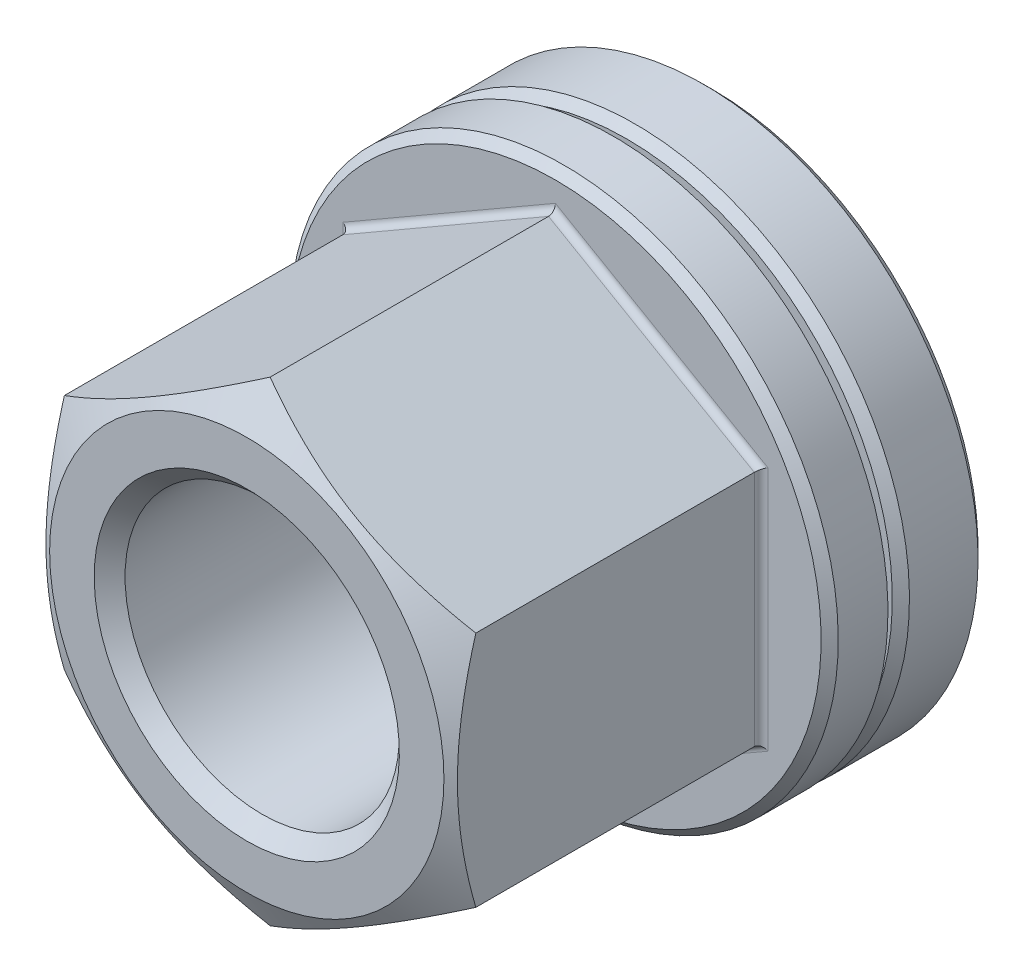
ISO-10303-21;
HEADER;
FILE_DESCRIPTION(('STEP AP214'),'2;1');
FILE_NAME('part.step','',(''),(''),'','','');
FILE_SCHEMA(('AUTOMOTIVE_DESIGN { 1 0 10303 214 1 1 1 1 }'));
ENDSEC;
DATA;
#1=APPLICATION_CONTEXT('core data for automotive mechanical design processes');
#2=APPLICATION_PROTOCOL_DEFINITION('international standard','automotive_design',2000,#1);
#3=PRODUCT_CONTEXT('',#1,'mechanical');
#4=PRODUCT('Part','Part','',(#3));
#5=PRODUCT_RELATED_PRODUCT_CATEGORY('part','',(#4));
#6=PRODUCT_DEFINITION_FORMATION('','',#4);
#7=PRODUCT_DEFINITION_CONTEXT('part definition',#1,'design');
#8=PRODUCT_DEFINITION('design','',#6,#7);
#9=PRODUCT_DEFINITION_SHAPE('','',#8);
#10=(LENGTH_UNIT() NAMED_UNIT(*) SI_UNIT(.MILLI.,.METRE.));
#11=(NAMED_UNIT(*) PLANE_ANGLE_UNIT() SI_UNIT($,.RADIAN.));
#12=(NAMED_UNIT(*) SI_UNIT($,.STERADIAN.) SOLID_ANGLE_UNIT());
#13=UNCERTAINTY_MEASURE_WITH_UNIT(LENGTH_MEASURE(1.E-05),#10,'distance_accuracy_value','');
#14=(GEOMETRIC_REPRESENTATION_CONTEXT(3) GLOBAL_UNCERTAINTY_ASSIGNED_CONTEXT((#13)) GLOBAL_UNIT_ASSIGNED_CONTEXT((#10,
#11,#12)) REPRESENTATION_CONTEXT('',''));
#15=CARTESIAN_POINT('',(0.,0.,0.));
#16=DIRECTION('',(0.,0.,1.));
#17=DIRECTION('',(1.,0.,0.));
#18=AXIS2_PLACEMENT_3D('',#15,#16,#17);
#19=CARTESIAN_POINT('',(1.19343424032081E-08,0.,36.8822269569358));
#20=DIRECTION('',(0.,0.,1.));
#21=DIRECTION('',(-1.,0.,0.));
#22=AXIS2_PLACEMENT_3D('',#19,#20,#21);
#23=SPHERICAL_SURFACE('',#22,35.0000001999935);
#24=CARTESIAN_POINT('',(0.,0.,5.));
#25=DIRECTION('',(0.,0.,1.));
#26=DIRECTION('',(0.,-1.,0.));
#27=AXIS2_PLACEMENT_3D('',#24,#25,#26);
#28=CIRCLE('',#27,14.4403468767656);
#29=CARTESIAN_POINT('',(-14.4403468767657,0.,5.));
#30=VERTEX_POINT('',#29);
#31=EDGE_CURVE('E105',#30,#30,#28,.T.);
#32=CARTESIAN_POINT('',(0.,0.,5.75346191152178));
#33=DIRECTION('',(0.,0.,1.));
#34=DIRECTION('',(0.,-1.,0.));
#35=AXIS2_PLACEMENT_3D('',#32,#33,#34);
#36=CIRCLE('',#35,16.0000000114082);
#37=CARTESIAN_POINT('',(-16.0000000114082,0.,5.75346191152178));
#38=VERTEX_POINT('',#37);
#39=EDGE_CURVE('E320',#38,#38,#36,.T.);
#40=CARTESIAN_POINT('',(-14.4403468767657,0.,5.));
#41=CARTESIAN_POINT('',(-14.4567841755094,0.,5.0074449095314));
#42=CARTESIAN_POINT('',(-14.4732157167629,0.,5.01490253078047));
#43=CARTESIAN_POINT('',(-14.5060672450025,0.,5.02984317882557));
#44=CARTESIAN_POINT('',(-14.5224872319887,0.,5.0373262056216));
#45=CARTESIAN_POINT('',(-14.5553156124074,0.,5.05231764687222));
#46=CARTESIAN_POINT('',(-14.5717240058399,0.,5.05982606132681));
#47=CARTESIAN_POINT('',(-14.6045291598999,0.,5.07486825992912));
#48=CARTESIAN_POINT('',(-14.6209259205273,0.,5.08240204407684));
#49=CARTESIAN_POINT('',(-14.6537077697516,0.,5.09749496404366));
#50=CARTESIAN_POINT('',(-14.6700928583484,0.,5.10505409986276));
#51=CARTESIAN_POINT('',(-14.7028513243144,0.,5.12019770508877));
#52=CARTESIAN_POINT('',(-14.7192247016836,0.,5.12778217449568));
#53=CARTESIAN_POINT('',(-14.7519597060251,0.,5.14297642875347));
#54=CARTESIAN_POINT('',(-14.7683213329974,0.,5.15058621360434));
#55=CARTESIAN_POINT('',(-14.8010327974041,0.,5.16583108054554));
#56=CARTESIAN_POINT('',(-14.8173826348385,0.,5.17346616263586));
#57=CARTESIAN_POINT('',(-14.8500704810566,0.,5.18876160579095));
#58=CARTESIAN_POINT('',(-14.8664084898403,0.,5.19642196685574));
#59=CARTESIAN_POINT('',(-14.8990726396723,0.,5.21176794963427));
#60=CARTESIAN_POINT('',(-14.9153987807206,0.,5.21945357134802));
#61=CARTESIAN_POINT('',(-14.9480391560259,0.,5.23485005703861));
#62=CARTESIAN_POINT('',(-14.9643533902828,0.,5.24256092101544));
#63=CARTESIAN_POINT('',(-14.9969699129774,0.,5.25800787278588));
#64=CARTESIAN_POINT('',(-15.0132722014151,0.,5.26574396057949));
#65=CARTESIAN_POINT('',(-15.0458647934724,0.,5.28124134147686));
#66=CARTESIAN_POINT('',(-15.0621550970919,0.,5.28900263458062));
#67=CARTESIAN_POINT('',(-15.0947236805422,0.,5.30455040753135));
#68=CARTESIAN_POINT('',(-15.111001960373,0.,5.31233688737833));
#69=CARTESIAN_POINT('',(-15.1435464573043,0.,5.32793501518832));
#70=CARTESIAN_POINT('',(-15.1598126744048,0.,5.33574666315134));
#71=CARTESIAN_POINT('',(-15.1923330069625,0.,5.35139510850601));
#72=CARTESIAN_POINT('',(-15.2085871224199,0.,5.35923190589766));
#73=CARTESIAN_POINT('',(-15.2410832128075,0.,5.37493063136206));
#74=CARTESIAN_POINT('',(-15.2573251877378,0.,5.38279255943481));
#75=CARTESIAN_POINT('',(-15.2897969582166,0.,5.39854152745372));
#76=CARTESIAN_POINT('',(-15.3060267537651,0.,5.40642856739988));
#77=CARTESIAN_POINT('',(-15.3384741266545,0.,5.42222774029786));
#78=CARTESIAN_POINT('',(-15.3546917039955,0.,5.43013987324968));
#79=CARTESIAN_POINT('',(-15.3871146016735,0.,5.44598921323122));
#80=CARTESIAN_POINT('',(-15.4033199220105,0.,5.45392642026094));
#81=CARTESIAN_POINT('',(-15.4357182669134,0.,5.46982588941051));
#82=CARTESIAN_POINT('',(-15.4519112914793,0.,5.47778815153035));
#83=CARTESIAN_POINT('',(-15.4842850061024,0.,5.49373771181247));
#84=CARTESIAN_POINT('',(-15.5004656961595,0.,5.50172500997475));
#85=CARTESIAN_POINT('',(-15.5328147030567,0.,5.51772462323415));
#86=CARTESIAN_POINT('',(-15.5489830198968,0.,5.52573693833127));
#87=CARTESIAN_POINT('',(-15.5813072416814,0.,5.54178656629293));
#88=CARTESIAN_POINT('',(-15.5974631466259,0.,5.54982387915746));
#89=CARTESIAN_POINT('',(-15.6297625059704,0.,5.56592348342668));
#90=CARTESIAN_POINT('',(-15.6459059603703,0.,5.57398577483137));
#91=CARTESIAN_POINT('',(-15.6781803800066,0.,5.59013531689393));
#92=CARTESIAN_POINT('',(-15.6943113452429,0.,5.5982225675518));
#93=CARTESIAN_POINT('',(-15.7265607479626,0.,5.61442200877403));
#94=CARTESIAN_POINT('',(-15.7426791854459,0.,5.62253419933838));
#95=CARTESIAN_POINT('',(-15.7749034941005,0.,5.63878350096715));
#96=CARTESIAN_POINT('',(-15.7910093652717,0.,5.64692061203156));
#97=CARTESIAN_POINT('',(-15.8232085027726,0.,5.66321973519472));
#98=CARTESIAN_POINT('',(-15.8393017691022,0.,5.67138174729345));
#99=CARTESIAN_POINT('',(-15.8714756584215,0.,5.68773065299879));
#100=CARTESIAN_POINT('',(-15.887556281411,0.,5.6959175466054));
#101=CARTESIAN_POINT('',(-15.9197048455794,0.,5.71231619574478));
#102=CARTESIAN_POINT('',(-15.9357727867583,0.,5.72052795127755));
#103=CARTESIAN_POINT('',(-15.9678959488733,0.,5.73697630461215));
#104=CARTESIAN_POINT('',(-15.9839511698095,0.,5.74521290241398));
#105=CARTESIAN_POINT('',(-16.0000000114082,0.,5.75346191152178));
#106=B_SPLINE_CURVE_WITH_KNOTS('',3,(#40,#41,#42,#43,#44,#45,#46,#47,#48,#49,#50,#51,#52,#53,
#54,#55,#56,#57,#58,#59,#60,#61,#62,#63,#64,#65,#66,#67,#68,#69,#70,#71,#72,#73,#74,#75,#76,#77,
#78,#79,#80,#81,#82,#83,#84,#85,#86,#87,#88,#89,#90,#91,#92,#93,#94,#95,#96,#97,#98,#99,#100,
#101,#102,#103,#104,#105),.UNSPECIFIED.,.F.,.F.,(4,2,2,2,2,2,2,2,2,2,2,2,2,2,2,2,2,2,2,2,2,2,2,
2,2,2,2,2,2,2,2,2,4),(0.,0.0541341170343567,0.108268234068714,0.162402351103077,
0.216536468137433,0.270670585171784,0.324804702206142,0.378938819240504,0.433072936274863,
0.487207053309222,0.54134117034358,0.595475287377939,0.649609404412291,0.70374352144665,
0.757877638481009,0.812011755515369,0.866145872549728,0.920279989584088,0.974414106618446,
1.0285482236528,1.08268234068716,1.13681645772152,1.19095057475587,1.24508469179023,
1.29921880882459,1.35335292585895,1.40748704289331,1.46162115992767,1.51575527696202,
1.56988939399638,1.62402351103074,1.6781576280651,1.73229174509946),.UNSPECIFIED.);
#107=EDGE_CURVE('BSEAM14',#30,#38,#106,.T.);
#108=ORIENTED_EDGE('',*,*,#31,.T.);
#109=ORIENTED_EDGE('',*,*,#39,.F.);
#110=ORIENTED_EDGE('',*,*,#107,.T.);
#111=ORIENTED_EDGE('',*,*,#107,.F.);
#112=EDGE_LOOP('',(#108,#110,#109,#111));
#113=FACE_BOUND('',#112,.T.);
#114=ADVANCED_FACE('F14',(#113),#23,.T.);
#115=CARTESIAN_POINT('',(-15.5,0.,5.));
#116=DIRECTION('',(0.,0.,1.));
#117=DIRECTION('',(0.,-1.,0.));
#118=AXIS2_PLACEMENT_3D('',#115,#116,#117);
#119=PLANE('',#118);
#120=CARTESIAN_POINT('',(0.,0.,5.));
#121=DIRECTION('',(0.,0.,1.));
#122=DIRECTION('',(0.,-1.,0.));
#123=AXIS2_PLACEMENT_3D('',#120,#121,#122);
#124=CIRCLE('',#123,15.5);
#125=CARTESIAN_POINT('',(0.,-15.5,5.));
#126=VERTEX_POINT('',#125);
#127=EDGE_CURVE('E356',#126,#126,#124,.T.);
#128=ORIENTED_EDGE('',*,*,#127,.T.);
#129=EDGE_LOOP('',(#128));
#130=FACE_BOUND('',#129,.T.);
#131=ORIENTED_EDGE('',*,*,#31,.F.);
#132=EDGE_LOOP('',(#131));
#133=FACE_BOUND('',#132,.T.);
#134=ADVANCED_FACE('F225',(#130,#133),#119,.T.);
#135=CARTESIAN_POINT('',(0.,0.,5.));
#136=DIRECTION('',(0.,0.,-1.));
#137=DIRECTION('',(0.,1.,0.));
#138=AXIS2_PLACEMENT_3D('',#135,#136,#137);
#139=CONICAL_SURFACE('',#138,15.5,0.785398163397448);
#140=CARTESIAN_POINT('',(0.,0.,4.5));
#141=DIRECTION('',(0.,0.,1.));
#142=DIRECTION('',(0.,-1.,0.));
#143=AXIS2_PLACEMENT_3D('',#140,#141,#142);
#144=CIRCLE('',#143,16.);
#145=CARTESIAN_POINT('',(0.,-16.,4.5));
#146=VERTEX_POINT('',#145);
#147=EDGE_CURVE('E353',#146,#146,#144,.T.);
#148=ORIENTED_EDGE('',*,*,#147,.T.);
#149=EDGE_LOOP('',(#148));
#150=FACE_BOUND('',#149,.T.);
#151=ORIENTED_EDGE('',*,*,#127,.F.);
#152=EDGE_LOOP('',(#151));
#153=FACE_BOUND('',#152,.T.);
#154=ADVANCED_FACE('F221',(#150,#153),#139,.T.);
#155=CARTESIAN_POINT('',(0.,0.,37.153462));
#156=DIRECTION('',(0.,0.,1.));
#157=DIRECTION('',(0.,-1.,0.));
#158=AXIS2_PLACEMENT_3D('',#155,#156,#157);
#159=CYLINDRICAL_SURFACE('',#158,16.);
#160=CARTESIAN_POINT('',(0.,0.,0.5));
#161=DIRECTION('',(0.,0.,1.));
#162=DIRECTION('',(0.,-1.,0.));
#163=AXIS2_PLACEMENT_3D('',#160,#161,#162);
#164=CIRCLE('',#163,16.);
#165=CARTESIAN_POINT('',(0.,-16.,0.5));
#166=VERTEX_POINT('',#165);
#167=EDGE_CURVE('E350',#166,#166,#164,.T.);
#168=ORIENTED_EDGE('',*,*,#167,.T.);
#169=EDGE_LOOP('',(#168));
#170=FACE_BOUND('',#169,.T.);
#171=ORIENTED_EDGE('',*,*,#147,.F.);
#172=EDGE_LOOP('',(#171));
#173=FACE_BOUND('',#172,.T.);
#174=ADVANCED_FACE('F217',(#170,#173),#159,.T.);
#175=CARTESIAN_POINT('',(0.,0.,0.5));
#176=DIRECTION('',(0.,0.,1.));
#177=DIRECTION('',(0.,-1.,0.));
#178=AXIS2_PLACEMENT_3D('',#175,#176,#177);
#179=CONICAL_SURFACE('',#178,16.,0.785398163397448);
#180=CARTESIAN_POINT('',(0.,0.,0.));
#181=DIRECTION('',(0.,0.,1.));
#182=DIRECTION('',(0.,-1.,0.));
#183=AXIS2_PLACEMENT_3D('',#180,#181,#182);
#184=CIRCLE('',#183,15.5);
#185=CARTESIAN_POINT('',(0.,-15.5,0.));
#186=VERTEX_POINT('',#185);
#187=EDGE_CURVE('E347',#186,#186,#184,.T.);
#188=ORIENTED_EDGE('',*,*,#187,.T.);
#189=EDGE_LOOP('',(#188));
#190=FACE_BOUND('',#189,.T.);
#191=ORIENTED_EDGE('',*,*,#167,.F.);
#192=EDGE_LOOP('',(#191));
#193=FACE_BOUND('',#192,.T.);
#194=ADVANCED_FACE('F213',(#190,#193),#179,.T.);
#195=CARTESIAN_POINT('',(-10.,0.,0.));
#196=DIRECTION('',(0.,0.,-1.));
#197=DIRECTION('',(0.,1.,0.));
#198=AXIS2_PLACEMENT_3D('',#195,#196,#197);
#199=PLANE('',#198);
#200=CARTESIAN_POINT('',(0.,0.,0.));
#201=DIRECTION('',(0.,0.,1.));
#202=DIRECTION('',(0.,-1.,0.));
#203=AXIS2_PLACEMENT_3D('',#200,#201,#202);
#204=CIRCLE('',#203,10.);
#205=CARTESIAN_POINT('',(0.,-10.,0.));
#206=VERTEX_POINT('',#205);
#207=EDGE_CURVE('E344',#206,#206,#204,.T.);
#208=ORIENTED_EDGE('',*,*,#207,.T.);
#209=EDGE_LOOP('',(#208));
#210=FACE_BOUND('',#209,.T.);
#211=ORIENTED_EDGE('',*,*,#187,.F.);
#212=EDGE_LOOP('',(#211));
#213=FACE_BOUND('',#212,.T.);
#214=ADVANCED_FACE('F209',(#210,#213),#199,.T.);
#215=CARTESIAN_POINT('',(0.,0.,0.));
#216=DIRECTION('',(0.,0.,-1.));
#217=DIRECTION('',(0.,1.,0.));
#218=AXIS2_PLACEMENT_3D('',#215,#216,#217);
#219=CONICAL_SURFACE('',#218,10.,0.785398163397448);
#220=CARTESIAN_POINT('',(0.,0.,0.5));
#221=DIRECTION('',(0.,0.,1.));
#222=DIRECTION('',(0.,-1.,0.));
#223=AXIS2_PLACEMENT_3D('',#220,#221,#222);
#224=CIRCLE('',#223,9.5);
#225=CARTESIAN_POINT('',(0.,-9.5,0.5));
#226=VERTEX_POINT('',#225);
#227=EDGE_CURVE('E341',#226,#226,#224,.T.);
#228=ORIENTED_EDGE('',*,*,#227,.T.);
#229=EDGE_LOOP('',(#228));
#230=FACE_BOUND('',#229,.T.);
#231=ORIENTED_EDGE('',*,*,#207,.F.);
#232=EDGE_LOOP('',(#231));
#233=FACE_BOUND('',#232,.T.);
#234=ADVANCED_FACE('F205',(#230,#233),#219,.F.);
#235=CARTESIAN_POINT('',(0.,0.,37.153462));
#236=DIRECTION('',(0.,0.,1.));
#237=DIRECTION('',(0.,-1.,0.));
#238=AXIS2_PLACEMENT_3D('',#235,#236,#237);
#239=CYLINDRICAL_SURFACE('',#238,9.5);
#240=CARTESIAN_POINT('',(0.,0.,3.089156));
#241=DIRECTION('',(0.,0.,1.));
#242=DIRECTION('',(0.,-1.,0.));
#243=AXIS2_PLACEMENT_3D('',#240,#241,#242);
#244=CIRCLE('',#243,9.5);
#245=CARTESIAN_POINT('',(0.,-9.5,3.089156));
#246=VERTEX_POINT('',#245);
#247=EDGE_CURVE('E338',#246,#246,#244,.T.);
#248=ORIENTED_EDGE('',*,*,#247,.T.);
#249=EDGE_LOOP('',(#248));
#250=FACE_BOUND('',#249,.T.);
#251=ORIENTED_EDGE('',*,*,#227,.F.);
#252=EDGE_LOOP('',(#251));
#253=FACE_BOUND('',#252,.T.);
#254=ADVANCED_FACE('F201',(#250,#253),#239,.F.);
#255=CARTESIAN_POINT('',(-9.5,0.,3.089156));
#256=DIRECTION('',(0.,0.,-1.));
#257=DIRECTION('',(0.,1.,0.));
#258=AXIS2_PLACEMENT_3D('',#255,#256,#257);
#259=PLANE('',#258);
#260=CARTESIAN_POINT('',(0.,0.,3.089156));
#261=DIRECTION('',(0.,0.,1.));
#262=DIRECTION('',(0.,-1.,0.));
#263=AXIS2_PLACEMENT_3D('',#260,#261,#262);
#264=CIRCLE('',#263,8.);
#265=CARTESIAN_POINT('',(0.,-8.,3.089156));
#266=VERTEX_POINT('',#265);
#267=EDGE_CURVE('E335',#266,#266,#264,.T.);
#268=ORIENTED_EDGE('',*,*,#267,.T.);
#269=EDGE_LOOP('',(#268));
#270=FACE_BOUND('',#269,.T.);
#271=ORIENTED_EDGE('',*,*,#247,.F.);
#272=EDGE_LOOP('',(#271));
#273=FACE_BOUND('',#272,.T.);
#274=ADVANCED_FACE('F197',(#270,#273),#259,.T.);
#275=CARTESIAN_POINT('',(0.,0.,37.153462));
#276=DIRECTION('',(0.,0.,1.));
#277=DIRECTION('',(0.,-1.,0.));
#278=AXIS2_PLACEMENT_3D('',#275,#276,#277);
#279=CYLINDRICAL_SURFACE('',#278,8.);
#280=CARTESIAN_POINT('',(0.,0.,26.2534620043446));
#281=DIRECTION('',(0.,0.,1.));
#282=DIRECTION('',(0.,-1.,0.));
#283=AXIS2_PLACEMENT_3D('',#280,#281,#282);
#284=CIRCLE('',#283,8.);
#285=CARTESIAN_POINT('',(0.,-8.,26.2534620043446));
#286=VERTEX_POINT('',#285);
#287=EDGE_CURVE('E332',#286,#286,#284,.T.);
#288=ORIENTED_EDGE('',*,*,#287,.T.);
#289=EDGE_LOOP('',(#288));
#290=FACE_BOUND('',#289,.T.);
#291=ORIENTED_EDGE('',*,*,#267,.F.);
#292=EDGE_LOOP('',(#291));
#293=FACE_BOUND('',#292,.T.);
#294=ADVANCED_FACE('F193',(#290,#293),#279,.F.);
#295=CARTESIAN_POINT('',(0.,0.,26.2534620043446));
#296=DIRECTION('',(0.,0.,1.));
#297=DIRECTION('',(0.,-1.,0.));
#298=AXIS2_PLACEMENT_3D('',#295,#296,#297);
#299=CONICAL_SURFACE('',#298,8.,0.785398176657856);
#300=CARTESIAN_POINT('',(0.,0.,27.1534619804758));
#301=DIRECTION('',(0.,0.,1.));
#302=DIRECTION('',(0.,-1.,0.));
#303=AXIS2_PLACEMENT_3D('',#300,#301,#302);
#304=CIRCLE('',#303,8.9);
#305=CARTESIAN_POINT('',(0.,-8.9,27.1534619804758));
#306=VERTEX_POINT('',#305);
#307=EDGE_CURVE('E329',#306,#306,#304,.T.);
#308=ORIENTED_EDGE('',*,*,#307,.T.);
#309=EDGE_LOOP('',(#308));
#310=FACE_BOUND('',#309,.T.);
#311=ORIENTED_EDGE('',*,*,#287,.F.);
#312=EDGE_LOOP('',(#311));
#313=FACE_BOUND('',#312,.T.);
#314=ADVANCED_FACE('F189',(#310,#313),#299,.F.);
#315=CARTESIAN_POINT('',(-11.4999972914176,0.,27.1534619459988));
#316=DIRECTION('',(0.,0.,1.));
#317=DIRECTION('',(0.,-1.,0.));
#318=AXIS2_PLACEMENT_3D('',#315,#316,#317);
#319=PLANE('',#318);
#320=CARTESIAN_POINT('',(0.,0.,27.1534619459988));
#321=DIRECTION('',(0.,0.,-1.));
#322=DIRECTION('',(-1.,0.,0.));
#323=AXIS2_PLACEMENT_3D('',#320,#321,#322);
#324=CIRCLE('',#323,11.5);
#325=CARTESIAN_POINT('',(-11.5,0.,27.1534619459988));
#326=VERTEX_POINT('',#325);
#327=EDGE_CURVE('E265',#326,#326,#324,.T.);
#328=ORIENTED_EDGE('',*,*,#327,.F.);
#329=EDGE_LOOP('',(#328));
#330=FACE_BOUND('',#329,.T.);
#331=ORIENTED_EDGE('',*,*,#307,.F.);
#332=EDGE_LOOP('',(#331));
#333=FACE_BOUND('',#332,.T.);
#334=ADVANCED_FACE('F185',(#330,#333),#319,.T.);
#335=CARTESIAN_POINT('',(-13.5999972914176,0.,9.15346191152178));
#336=DIRECTION('',(0.,0.,1.));
#337=DIRECTION('',(0.,-1.,0.));
#338=AXIS2_PLACEMENT_3D('',#335,#336,#337);
#339=PLANE('',#338);
#340=DIRECTION('',(0.,1.,0.));
#341=VECTOR('',#340,1.);
#342=CARTESIAN_POINT('',(-12.4,6.92820323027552,9.15346191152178));
#343=LINE('',#342,#341);
#344=CARTESIAN_POINT('',(-12.4,-7.15914333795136,9.15346191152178));
#345=VERTEX_POINT('',#344);
#346=CARTESIAN_POINT('',(-12.4,7.15914333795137,9.15346191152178));
#347=VERTEX_POINT('',#346);
#348=EDGE_CURVE('E291',#345,#347,#343,.T.);
#349=ORIENTED_EDGE('',*,*,#348,.T.);
#350=DIRECTION('',(0.866025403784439,0.5,0.));
#351=VECTOR('',#350,1.);
#352=CARTESIAN_POINT('',(-0.199999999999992,14.2028166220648,9.15346191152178));
#353=LINE('',#352,#351);
#354=CARTESIAN_POINT('',(0.,14.3182866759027,9.15346191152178));
#355=VERTEX_POINT('',#354);
#356=EDGE_CURVE('E288',#347,#355,#353,.T.);
#357=ORIENTED_EDGE('',*,*,#356,.T.);
#358=DIRECTION('',(0.866025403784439,-0.5,0.));
#359=VECTOR('',#358,1.);
#360=CARTESIAN_POINT('',(12.2,7.27461339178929,9.15346191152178));
#361=LINE('',#360,#359);
#362=CARTESIAN_POINT('',(12.4,7.15914333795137,9.15346191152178));
#363=VERTEX_POINT('',#362);
#364=EDGE_CURVE('E104',#355,#363,#361,.T.);
#365=ORIENTED_EDGE('',*,*,#364,.T.);
#366=DIRECTION('',(0.,-1.,0.));
#367=VECTOR('',#366,1.);
#368=CARTESIAN_POINT('',(12.4,-6.92820323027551,9.15346191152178));
#369=LINE('',#368,#367);
#370=CARTESIAN_POINT('',(12.4,-7.15914333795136,9.15346191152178));
#371=VERTEX_POINT('',#370);
#372=EDGE_CURVE('E296',#363,#371,#369,.T.);
#373=ORIENTED_EDGE('',*,*,#372,.T.);
#374=DIRECTION('',(-0.866025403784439,-0.5,0.));
#375=VECTOR('',#374,1.);
#376=CARTESIAN_POINT('',(0.2,-14.2028166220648,9.15346191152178));
#377=LINE('',#376,#375);
#378=CARTESIAN_POINT('',(0.,-14.3182866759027,9.15346191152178));
#379=VERTEX_POINT('',#378);
#380=EDGE_CURVE('E294',#371,#379,#377,.T.);
#381=ORIENTED_EDGE('',*,*,#380,.T.);
#382=DIRECTION('',(-0.866025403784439,0.5,0.));
#383=VECTOR('',#382,1.);
#384=CARTESIAN_POINT('',(-12.2,-7.27461339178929,9.15346191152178));
#385=LINE('',#384,#383);
#386=EDGE_CURVE('E263',#379,#345,#385,.T.);
#387=ORIENTED_EDGE('',*,*,#386,.T.);
#388=EDGE_LOOP('',(#349,#357,#365,#373,#381,#387));
#389=FACE_BOUND('',#388,.T.);
#390=CARTESIAN_POINT('',(0.,0.,9.15346191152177));
#391=DIRECTION('',(0.,0.,1.));
#392=DIRECTION('',(0.,-1.,0.));
#393=AXIS2_PLACEMENT_3D('',#390,#391,#392);
#394=CIRCLE('',#393,15.5000000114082);
#395=CARTESIAN_POINT('',(0.,-15.5000000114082,9.15346191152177));
#396=VERTEX_POINT('',#395);
#397=EDGE_CURVE('E326',#396,#396,#394,.T.);
#398=ORIENTED_EDGE('',*,*,#397,.T.);
#399=EDGE_LOOP('',(#398));
#400=FACE_BOUND('',#399,.T.);
#401=ADVANCED_FACE('F181',(#389,#400),#339,.T.);
#402=CARTESIAN_POINT('',(0.,0.,9.15346191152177));
#403=DIRECTION('',(0.,0.,-1.));
#404=DIRECTION('',(0.,1.,0.));
#405=AXIS2_PLACEMENT_3D('',#402,#403,#404);
#406=CONICAL_SURFACE('',#405,15.5000000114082,0.785398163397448);
#407=CARTESIAN_POINT('',(0.,0.,8.65346191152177));
#408=DIRECTION('',(0.,0.,1.));
#409=DIRECTION('',(0.,-1.,0.));
#410=AXIS2_PLACEMENT_3D('',#407,#408,#409);
#411=CIRCLE('',#410,16.0000000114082);
#412=CARTESIAN_POINT('',(0.,-16.0000000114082,8.65346191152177));
#413=VERTEX_POINT('',#412);
#414=EDGE_CURVE('E323',#413,#413,#411,.T.);
#415=ORIENTED_EDGE('',*,*,#414,.T.);
#416=EDGE_LOOP('',(#415));
#417=FACE_BOUND('',#416,.T.);
#418=ORIENTED_EDGE('',*,*,#397,.F.);
#419=EDGE_LOOP('',(#418));
#420=FACE_BOUND('',#419,.T.);
#421=ADVANCED_FACE('F177',(#417,#420),#406,.T.);
#422=CARTESIAN_POINT('',(0.,0.,37.153462));
#423=DIRECTION('',(0.,0.,1.));
#424=DIRECTION('',(0.,-1.,0.));
#425=AXIS2_PLACEMENT_3D('',#422,#423,#424);
#426=CYLINDRICAL_SURFACE('',#425,16.0000000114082);
#427=ORIENTED_EDGE('',*,*,#39,.T.);
#428=EDGE_LOOP('',(#427));
#429=FACE_BOUND('',#428,.T.);
#430=ORIENTED_EDGE('',*,*,#414,.F.);
#431=EDGE_LOOP('',(#430));
#432=FACE_BOUND('',#431,.T.);
#433=ADVANCED_FACE('F174',(#429,#432),#426,.T.);
#434=CARTESIAN_POINT('',(12.,-6.92820323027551,-51.7456935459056));
#435=DIRECTION('',(1.,0.,0.));
#436=DIRECTION('',(0.,0.,-1.));
#437=AXIS2_PLACEMENT_3D('',#434,#435,#436);
#438=PLANE('',#437);
#439=DIRECTION('',(0.,0.,1.));
#440=VECTOR('',#439,1.);
#441=CARTESIAN_POINT('',(12.,-6.92820323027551,-27.5071436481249));
#442=LINE('',#441,#440);
#443=CARTESIAN_POINT('',(12.,-6.92820323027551,9.55346191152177));
#444=VERTEX_POINT('',#443);
#445=CARTESIAN_POINT('',(12.,-6.92820323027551,25.7929900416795));
#446=VERTEX_POINT('',#445);
#447=EDGE_CURVE('E84',#444,#446,#442,.T.);
#448=ORIENTED_EDGE('',*,*,#447,.F.);
#449=DIRECTION('',(0.,-1.,0.));
#450=VECTOR('',#449,1.);
#451=CARTESIAN_POINT('',(12.,6.92820323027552,9.55346191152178));
#452=LINE('',#451,#450);
#453=CARTESIAN_POINT('',(12.,6.92820323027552,9.55346191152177));
#454=VERTEX_POINT('',#453);
#455=EDGE_CURVE('E23',#444,#454,#452,.F.);
#456=ORIENTED_EDGE('',*,*,#455,.T.);
#457=DIRECTION('',(0.,0.,1.));
#458=VECTOR('',#457,1.);
#459=CARTESIAN_POINT('',(12.,6.92820323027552,-27.5071436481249));
#460=LINE('',#459,#458);
#461=CARTESIAN_POINT('',(12.,6.92820323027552,25.7929900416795));
#462=VERTEX_POINT('',#461);
#463=EDGE_CURVE('E90',#454,#462,#460,.T.);
#464=ORIENTED_EDGE('',*,*,#463,.T.);
#465=CARTESIAN_POINT('',(12.,-18.49528746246,21.0640773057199));
#466=CARTESIAN_POINT('',(12.,-18.2337104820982,21.1907664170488));
#467=CARTESIAN_POINT('',(12.,-17.9718234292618,21.3168150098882));
#468=CARTESIAN_POINT('',(12.,-17.4473644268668,21.5674858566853));
#469=CARTESIAN_POINT('',(12.,-17.1847924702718,21.6921080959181));
#470=CARTESIAN_POINT('',(12.,-16.3958805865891,22.0636509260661));
#471=CARTESIAN_POINT('',(12.,-15.8684238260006,22.3082091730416));
#472=CARTESIAN_POINT('',(12.,-14.8070160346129,22.7908665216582));
#473=CARTESIAN_POINT('',(12.,-14.273045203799,23.0289221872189));
#474=CARTESIAN_POINT('',(12.,-13.2008166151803,23.4951405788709));
#475=CARTESIAN_POINT('',(12.,-12.6625590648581,23.7233037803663));
#476=CARTESIAN_POINT('',(12.,-11.5639860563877,24.1740557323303));
#477=CARTESIAN_POINT('',(12.,-11.0035068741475,24.3962475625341));
#478=CARTESIAN_POINT('',(12.,-9.87594503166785,24.8235361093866));
#479=CARTESIAN_POINT('',(12.,-9.3088616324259,25.0286308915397));
#480=CARTESIAN_POINT('',(12.,-8.16830699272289,25.4162541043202));
#481=CARTESIAN_POINT('',(12.,-7.59485175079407,25.5988292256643));
#482=CARTESIAN_POINT('',(12.,-6.43966191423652,25.9354887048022));
#483=CARTESIAN_POINT('',(12.,-5.85793002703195,26.0895821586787));
#484=CARTESIAN_POINT('',(12.,-4.9806321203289,26.2933104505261));
#485=CARTESIAN_POINT('',(12.,-4.68819839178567,26.3565194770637));
#486=CARTESIAN_POINT('',(12.,-4.10135464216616,26.4730355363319));
#487=CARTESIAN_POINT('',(12.,-3.80694466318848,26.5263427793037));
#488=CARTESIAN_POINT('',(12.,-3.21635927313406,26.6221075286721));
#489=CARTESIAN_POINT('',(12.,-2.92018387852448,26.6645651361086));
#490=CARTESIAN_POINT('',(12.,-2.32639149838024,26.7377793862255));
#491=CARTESIAN_POINT('',(12.,-2.02877456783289,26.7685364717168));
#492=CARTESIAN_POINT('',(12.,-1.43635028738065,26.8173593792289));
#493=CARTESIAN_POINT('',(12.,-1.14155605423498,26.8355833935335));
#494=CARTESIAN_POINT('',(12.,-0.551462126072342,26.8595566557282));
#495=CARTESIAN_POINT('',(12.,-0.256162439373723,26.8653061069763));
#496=CARTESIAN_POINT('',(12.,0.334417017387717,26.8641938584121));
#497=CARTESIAN_POINT('',(12.,0.629696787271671,26.8573320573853));
#498=CARTESIAN_POINT('',(12.,1.21970793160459,26.83116266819));
#499=CARTESIAN_POINT('',(12.,1.5144392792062,26.8118544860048));
#500=CARTESIAN_POINT('',(12.,2.22627700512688,26.7505956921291));
#501=CARTESIAN_POINT('',(12.,2.6428674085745,26.7025451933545));
#502=CARTESIAN_POINT('',(12.,3.47288278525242,26.5842227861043));
#503=CARTESIAN_POINT('',(12.,3.88630730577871,26.5139477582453));
#504=CARTESIAN_POINT('',(12.,4.70962196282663,26.3536764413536));
#505=CARTESIAN_POINT('',(12.,5.11950901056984,26.2636644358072));
#506=CARTESIAN_POINT('',(12.,5.93513577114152,26.0666590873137));
#507=CARTESIAN_POINT('',(12.,6.34087555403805,25.9596660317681));
#508=CARTESIAN_POINT('',(12.,7.1570709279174,25.7287828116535));
#509=CARTESIAN_POINT('',(12.,7.56743592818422,25.6045745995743));
#510=CARTESIAN_POINT('',(12.,8.38412221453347,25.3435750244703));
#511=CARTESIAN_POINT('',(12.,8.79044347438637,25.2067835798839));
#512=CARTESIAN_POINT('',(12.,9.59924755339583,24.9227675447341));
#513=CARTESIAN_POINT('',(12.,10.0017316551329,24.7755465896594));
#514=CARTESIAN_POINT('',(12.,10.8033814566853,24.4723789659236));
#515=CARTESIAN_POINT('',(12.,11.202547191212,24.316432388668));
#516=CARTESIAN_POINT('',(12.,12.1272668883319,23.9453703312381));
#517=CARTESIAN_POINT('',(12.,12.6517148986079,23.7275032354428));
#518=CARTESIAN_POINT('',(12.,13.6963021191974,23.2816452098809));
#519=CARTESIAN_POINT('',(12.,14.2164410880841,23.0536537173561));
#520=CARTESIAN_POINT('',(12.,15.253190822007,22.58952796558));
#521=CARTESIAN_POINT('',(12.,15.7698008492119,22.3533920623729));
#522=CARTESIAN_POINT('',(12.,16.7999623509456,21.8745810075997));
#523=CARTESIAN_POINT('',(12.,17.3135138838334,21.6319059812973));
#524=CARTESIAN_POINT('',(12.,18.3385763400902,21.140962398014));
#525=CARTESIAN_POINT('',(12.,18.8500846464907,20.8926883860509));
#526=CARTESIAN_POINT('',(12.,19.8709338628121,20.391724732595));
#527=CARTESIAN_POINT('',(12.,20.38027476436,20.1390350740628));
#528=CARTESIAN_POINT('',(12.,21.3970557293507,19.630011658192));
#529=CARTESIAN_POINT('',(12.,21.9044960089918,19.373678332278));
#530=CARTESIAN_POINT('',(12.,22.9178052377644,18.8579228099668));
#531=CARTESIAN_POINT('',(12.,23.4236741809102,18.5985006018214));
#532=CARTESIAN_POINT('',(12.,24.8574393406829,17.8585573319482));
#533=CARTESIAN_POINT('',(12.,25.7837375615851,17.3749398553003));
#534=CARTESIAN_POINT('',(12.,27.6328865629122,16.4011021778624));
#535=CARTESIAN_POINT('',(12.,28.5557372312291,15.9108817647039));
#536=CARTESIAN_POINT('',(12.,30.3965678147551,14.9265188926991));
#537=CARTESIAN_POINT('',(12.,31.314554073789,14.4323882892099));
#538=CARTESIAN_POINT('',(12.,32.6898986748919,13.6882309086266));
#539=CARTESIAN_POINT('',(12.,33.1480628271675,13.439691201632));
#540=CARTESIAN_POINT('',(12.,34.0639067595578,12.9417225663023));
#541=CARTESIAN_POINT('',(12.,34.5215865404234,12.6922936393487));
#542=CARTESIAN_POINT('',(12.,34.9790512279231,12.4424707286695));
#543=B_SPLINE_CURVE_WITH_KNOTS('',3,(#465,#466,#467,#468,#469,#470,#471,#472,#473,#474,#475,
#476,#477,#478,#479,#480,#481,#482,#483,#484,#485,#486,#487,#488,#489,#490,#491,#492,#493,#494,
#495,#496,#497,#498,#499,#500,#501,#502,#503,#504,#505,#506,#507,#508,#509,#510,#511,#512,#513,
#514,#515,#516,#517,#518,#519,#520,#521,#522,#523,#524,#525,#526,#527,#528,#529,#530,#531,#532,
#533,#534,#535,#536,#537,#538,#539,#540,#541,#542),.UNSPECIFIED.,.F.,.F.,(4,2,2,2,2,2,2,2,2,2,2,
2,2,2,2,2,2,2,2,2,2,2,2,2,2,2,2,2,2,2,2,2,2,2,2,2,2,2,4),(0.,0.871923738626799,1.74385647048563,
3.48798599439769,5.24180585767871,6.99554134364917,8.80407249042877,10.6128079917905,
12.4177279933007,14.2220705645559,15.1194910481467,16.0168924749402,16.9142855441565,
17.811644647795,18.6974584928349,19.5832578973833,20.4690644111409,21.3549132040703,
22.6122720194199,23.8698073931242,25.1283477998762,26.3868669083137,27.6728770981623,
28.9588956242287,30.2444680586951,31.5300270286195,33.2335881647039,34.9372441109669,
36.6412459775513,38.3452152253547,40.0509232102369,41.7566377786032,43.4621520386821,
45.1676727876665,48.3024736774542,51.4373756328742,54.564945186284,56.1286507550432,
57.6923538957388),.UNSPECIFIED.);
#544=EDGE_CURVE('E99',#446,#462,#543,.T.);
#545=ORIENTED_EDGE('',*,*,#544,.F.);
#546=EDGE_LOOP('',(#448,#456,#464,#545));
#547=FACE_BOUND('',#546,.T.);
#548=ADVANCED_FACE('F107',(#547),#438,.T.);
#549=CARTESIAN_POINT('',(12.,6.92820323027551,-51.7456935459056));
#550=DIRECTION('',(0.5,0.866025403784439,0.));
#551=DIRECTION('',(-0.866025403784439,0.5,0.));
#552=AXIS2_PLACEMENT_3D('',#549,#550,#551);
#553=PLANE('',#552);
#554=ORIENTED_EDGE('',*,*,#463,.F.);
#555=DIRECTION('',(0.866025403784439,-0.5,0.));
#556=VECTOR('',#555,1.);
#557=CARTESIAN_POINT('',(0.,13.856406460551,9.55346191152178));
#558=LINE('',#557,#556);
#559=CARTESIAN_POINT('',(0.,13.856406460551,9.55346191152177));
#560=VERTEX_POINT('',#559);
#561=EDGE_CURVE('E9',#454,#560,#558,.F.);
#562=ORIENTED_EDGE('',*,*,#561,.T.);
#563=DIRECTION('',(0.,0.,1.));
#564=VECTOR('',#563,1.);
#565=CARTESIAN_POINT('',(0.,13.856406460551,-27.5071436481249));
#566=LINE('',#565,#564);
#567=CARTESIAN_POINT('',(0.,13.856406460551,25.7929900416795));
#568=VERTEX_POINT('',#567);
#569=EDGE_CURVE('E108',#560,#568,#566,.T.);
#570=ORIENTED_EDGE('',*,*,#569,.T.);
#571=CARTESIAN_POINT('',(12.0002,6.92808776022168,25.7929233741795));
#572=CARTESIAN_POINT('',(11.7364142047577,7.08038456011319,25.8808371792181));
#573=CARTESIAN_POINT('',(11.4716448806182,7.23324920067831,25.9647608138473));
#574=CARTESIAN_POINT('',(10.9399829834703,7.54020434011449,26.1235205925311));
#575=CARTESIAN_POINT('',(10.6730897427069,7.69429522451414,26.1983537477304));
#576=CARTESIAN_POINT('',(9.86810959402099,8.15905073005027,26.4077692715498));
#577=CARTESIAN_POINT('',(9.3268449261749,8.47155003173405,26.5268835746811));
#578=CARTESIAN_POINT('',(8.51686717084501,8.93919090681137,26.6665557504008));
#579=CARTESIAN_POINT('',(8.25057389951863,9.09293539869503,26.7063430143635));
#580=CARTESIAN_POINT('',(7.71675440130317,9.40113622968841,26.7730634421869));
#581=CARTESIAN_POINT('',(7.44922815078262,9.55559258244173,26.7999963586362));
#582=CARTESIAN_POINT('',(6.91372963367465,9.86476279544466,26.8403182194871));
#583=CARTESIAN_POINT('',(6.64575827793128,10.0194761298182,26.8537232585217));
#584=CARTESIAN_POINT('',(6.10956726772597,10.3290461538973,26.8667037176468));
#585=CARTESIAN_POINT('',(5.84134762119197,10.4839028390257,26.8662795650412));
#586=CARTESIAN_POINT('',(5.3399106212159,10.7734076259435,26.8525667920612));
#587=CARTESIAN_POINT('',(5.10665750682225,10.908076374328,26.8409508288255));
#588=CARTESIAN_POINT('',(4.64068775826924,11.1771041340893,26.8074788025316));
#589=CARTESIAN_POINT('',(4.40797116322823,11.3114631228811,26.7856220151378));
#590=CARTESIAN_POINT('',(3.94320092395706,11.5797983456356,26.7320493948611));
#591=CARTESIAN_POINT('',(3.711147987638,11.7137741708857,26.7003254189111));
#592=CARTESIAN_POINT('',(3.24813003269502,11.9810977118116,26.6275750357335));
#593=CARTESIAN_POINT('',(3.01716508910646,12.1144453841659,26.5865479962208));
#594=CARTESIAN_POINT('',(2.31605804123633,12.5192297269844,26.4484751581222));
#595=CARTESIAN_POINT('',(1.84794625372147,12.789494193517,26.3376619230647));
#596=CARTESIAN_POINT('',(0.918702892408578,13.3259930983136,26.0861610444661));
#597=CARTESIAN_POINT('',(0.457559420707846,13.5922344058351,25.9455324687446));
#598=CARTESIAN_POINT('',(-0.000199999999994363,13.8565219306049,25.7929233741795));
#599=B_SPLINE_CURVE_WITH_KNOTS('',3,(#571,#572,#573,#574,#575,#576,#577,#578,#579,#580,#581,
#582,#583,#584,#585,#586,#587,#588,#589,#590,#591,#592,#593,#594,#595,#596,#597,#598),
.UNSPECIFIED.,.F.,.F.,(4,2,2,2,2,2,2,2,2,2,2,2,2,4),(0.,0.951004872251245,1.90232158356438,
3.80900466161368,4.73894551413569,5.66890426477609,6.59775529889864,7.52657763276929,
8.33514643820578,9.14377244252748,9.95306755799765,10.7624176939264,12.4167102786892,
14.0677556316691),.UNSPECIFIED.);
#600=EDGE_CURVE('E109',#462,#568,#599,.T.);
#601=ORIENTED_EDGE('',*,*,#600,.F.);
#602=EDGE_LOOP('',(#554,#562,#570,#601));
#603=FACE_BOUND('',#602,.T.);
#604=ADVANCED_FACE('F167',(#603),#553,.T.);
#605=CARTESIAN_POINT('',(0.,13.856406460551,-51.7456935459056));
#606=DIRECTION('',(-0.5,0.866025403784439,0.));
#607=DIRECTION('',(-0.866025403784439,-0.5,0.));
#608=AXIS2_PLACEMENT_3D('',#605,#606,#607);
#609=PLANE('',#608);
#610=ORIENTED_EDGE('',*,*,#569,.F.);
#611=DIRECTION('',(0.866025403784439,0.5,0.));
#612=VECTOR('',#611,1.);
#613=CARTESIAN_POINT('',(-12.,6.92820323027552,9.55346191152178));
#614=LINE('',#613,#612);
#615=CARTESIAN_POINT('',(-12.,6.92820323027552,9.55346191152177));
#616=VERTEX_POINT('',#615);
#617=EDGE_CURVE('E285',#560,#616,#614,.F.);
#618=ORIENTED_EDGE('',*,*,#617,.T.);
#619=DIRECTION('',(0.,0.,1.));
#620=VECTOR('',#619,1.);
#621=CARTESIAN_POINT('',(-12.,6.92820323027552,-27.5071436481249));
#622=LINE('',#621,#620);
#623=CARTESIAN_POINT('',(-12.,6.92820323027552,25.7929900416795));
#624=VERTEX_POINT('',#623);
#625=EDGE_CURVE('E111',#616,#624,#622,.T.);
#626=ORIENTED_EDGE('',*,*,#625,.T.);
#627=CARTESIAN_POINT('',(0.000200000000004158,13.8565219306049,25.7929233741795));
#628=CARTESIAN_POINT('',(-0.263585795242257,13.7042251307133,25.8808371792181));
#629=CARTESIAN_POINT('',(-0.528355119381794,13.5513604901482,25.9647608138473));
#630=CARTESIAN_POINT('',(-1.06001701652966,13.244405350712,26.1235205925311));
#631=CARTESIAN_POINT('',(-1.32691025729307,13.0903144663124,26.1983537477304));
#632=CARTESIAN_POINT('',(-2.131890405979,12.6255589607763,26.4077692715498));
#633=CARTESIAN_POINT('',(-2.6731550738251,12.3130596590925,26.5268835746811));
#634=CARTESIAN_POINT('',(-3.48313282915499,11.8454187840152,26.6665557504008));
#635=CARTESIAN_POINT('',(-3.74942610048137,11.6916742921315,26.7063430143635));
#636=CARTESIAN_POINT('',(-4.28324559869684,11.3834734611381,26.7730634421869));
#637=CARTESIAN_POINT('',(-4.55077184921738,11.2290171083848,26.7999963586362));
#638=CARTESIAN_POINT('',(-5.08627036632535,10.9198468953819,26.8403182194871));
#639=CARTESIAN_POINT('',(-5.35424172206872,10.7651335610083,26.8537232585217));
#640=CARTESIAN_POINT('',(-5.89043273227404,10.4555635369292,26.8667037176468));
#641=CARTESIAN_POINT('',(-6.15865237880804,10.3007068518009,26.8662795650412));
#642=CARTESIAN_POINT('',(-6.66008937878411,10.0112020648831,26.8525667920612));
#643=CARTESIAN_POINT('',(-6.89334249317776,9.87653331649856,26.8409508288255));
#644=CARTESIAN_POINT('',(-7.35931224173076,9.60750555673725,26.8074788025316));
#645=CARTESIAN_POINT('',(-7.59202883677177,9.47314656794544,26.7856220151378));
#646=CARTESIAN_POINT('',(-8.05679907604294,9.2048113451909,26.7320493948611));
#647=CARTESIAN_POINT('',(-8.288852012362,9.07083551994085,26.7003254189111));
#648=CARTESIAN_POINT('',(-8.75186996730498,8.80351197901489,26.6275750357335));
#649=CARTESIAN_POINT('',(-8.98283491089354,8.67016430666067,26.5865479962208));
#650=CARTESIAN_POINT('',(-9.68394195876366,8.26537996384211,26.4484751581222));
#651=CARTESIAN_POINT('',(-10.1520537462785,7.99511549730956,26.3376619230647));
#652=CARTESIAN_POINT('',(-11.0812971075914,7.45861659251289,26.0861610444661));
#653=CARTESIAN_POINT('',(-11.5424405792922,7.19237528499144,25.9455324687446));
#654=CARTESIAN_POINT('',(-12.0002,6.92808776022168,25.7929233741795));
#655=B_SPLINE_CURVE_WITH_KNOTS('',3,(#627,#628,#629,#630,#631,#632,#633,#634,#635,#636,#637,
#638,#639,#640,#641,#642,#643,#644,#645,#646,#647,#648,#649,#650,#651,#652,#653,#654),
.UNSPECIFIED.,.F.,.F.,(4,2,2,2,2,2,2,2,2,2,2,2,2,4),(0.,0.951004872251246,1.90232158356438,
3.80900466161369,4.7389455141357,5.6689042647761,6.59775529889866,7.5265776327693,
8.33514643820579,9.14377244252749,9.95306755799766,10.7624176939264,12.4167102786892,
14.0677556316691),.UNSPECIFIED.);
#656=EDGE_CURVE('E113',#568,#624,#655,.T.);
#657=ORIENTED_EDGE('',*,*,#656,.F.);
#658=EDGE_LOOP('',(#610,#618,#626,#657));
#659=FACE_BOUND('',#658,.T.);
#660=ADVANCED_FACE('F163',(#659),#609,.T.);
#661=CARTESIAN_POINT('',(-12.,6.92820323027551,-51.7456935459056));
#662=DIRECTION('',(-1.,0.,0.));
#663=DIRECTION('',(0.,0.,1.));
#664=AXIS2_PLACEMENT_3D('',#661,#662,#663);
#665=PLANE('',#664);
#666=ORIENTED_EDGE('',*,*,#625,.F.);
#667=DIRECTION('',(0.,1.,0.));
#668=VECTOR('',#667,1.);
#669=CARTESIAN_POINT('',(-12.,-6.92820323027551,9.55346191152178));
#670=LINE('',#669,#668);
#671=CARTESIAN_POINT('',(-12.,-6.92820323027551,9.55346191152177));
#672=VERTEX_POINT('',#671);
#673=EDGE_CURVE('E283',#616,#672,#670,.F.);
#674=ORIENTED_EDGE('',*,*,#673,.T.);
#675=DIRECTION('',(0.,0.,1.));
#676=VECTOR('',#675,1.);
#677=CARTESIAN_POINT('',(-12.,-6.92820323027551,-27.5071436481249));
#678=LINE('',#677,#676);
#679=CARTESIAN_POINT('',(-12.,-6.92820323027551,25.7929900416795));
#680=VERTEX_POINT('',#679);
#681=EDGE_CURVE('E313',#672,#680,#678,.T.);
#682=ORIENTED_EDGE('',*,*,#681,.T.);
#683=CARTESIAN_POINT('',(-12.,-18.49528746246,21.0640773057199));
#684=CARTESIAN_POINT('',(-12.,-18.2337104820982,21.1907664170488));
#685=CARTESIAN_POINT('',(-12.,-17.9718234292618,21.3168150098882));
#686=CARTESIAN_POINT('',(-12.,-17.4473644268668,21.5674858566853));
#687=CARTESIAN_POINT('',(-12.,-17.1847924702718,21.6921080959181));
#688=CARTESIAN_POINT('',(-12.,-16.3958805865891,22.0636509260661));
#689=CARTESIAN_POINT('',(-12.,-15.8684238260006,22.3082091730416));
#690=CARTESIAN_POINT('',(-12.,-14.8070160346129,22.7908665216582));
#691=CARTESIAN_POINT('',(-12.,-14.273045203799,23.0289221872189));
#692=CARTESIAN_POINT('',(-12.,-13.2008166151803,23.4951405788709));
#693=CARTESIAN_POINT('',(-12.,-12.6625590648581,23.7233037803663));
#694=CARTESIAN_POINT('',(-12.,-11.5639860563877,24.1740557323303));
#695=CARTESIAN_POINT('',(-12.,-11.0035068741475,24.3962475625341));
#696=CARTESIAN_POINT('',(-12.,-9.87594503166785,24.8235361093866));
#697=CARTESIAN_POINT('',(-12.,-9.3088616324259,25.0286308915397));
#698=CARTESIAN_POINT('',(-12.,-8.16830699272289,25.4162541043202));
#699=CARTESIAN_POINT('',(-12.,-7.59485175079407,25.5988292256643));
#700=CARTESIAN_POINT('',(-12.,-6.43966191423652,25.9354887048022));
#701=CARTESIAN_POINT('',(-12.,-5.85793002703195,26.0895821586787));
#702=CARTESIAN_POINT('',(-12.,-4.9806321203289,26.2933104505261));
#703=CARTESIAN_POINT('',(-12.,-4.68819839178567,26.3565194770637));
#704=CARTESIAN_POINT('',(-12.,-4.10135464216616,26.4730355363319));
#705=CARTESIAN_POINT('',(-12.,-3.80694466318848,26.5263427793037));
#706=CARTESIAN_POINT('',(-12.,-3.21635927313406,26.6221075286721));
#707=CARTESIAN_POINT('',(-12.,-2.92018387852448,26.6645651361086));
#708=CARTESIAN_POINT('',(-12.,-2.32639149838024,26.7377793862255));
#709=CARTESIAN_POINT('',(-12.,-2.02877456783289,26.7685364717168));
#710=CARTESIAN_POINT('',(-12.,-1.43635028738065,26.8173593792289));
#711=CARTESIAN_POINT('',(-12.,-1.14155605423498,26.8355833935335));
#712=CARTESIAN_POINT('',(-12.,-0.551462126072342,26.8595566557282));
#713=CARTESIAN_POINT('',(-12.,-0.256162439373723,26.8653061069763));
#714=CARTESIAN_POINT('',(-12.,0.334417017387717,26.8641938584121));
#715=CARTESIAN_POINT('',(-12.,0.629696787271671,26.8573320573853));
#716=CARTESIAN_POINT('',(-12.,1.21970793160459,26.83116266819));
#717=CARTESIAN_POINT('',(-12.,1.5144392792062,26.8118544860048));
#718=CARTESIAN_POINT('',(-12.,2.22627700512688,26.7505956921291));
#719=CARTESIAN_POINT('',(-12.,2.6428674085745,26.7025451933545));
#720=CARTESIAN_POINT('',(-12.,3.47288278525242,26.5842227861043));
#721=CARTESIAN_POINT('',(-12.,3.88630730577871,26.5139477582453));
#722=CARTESIAN_POINT('',(-12.,4.70962196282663,26.3536764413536));
#723=CARTESIAN_POINT('',(-12.,5.11950901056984,26.2636644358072));
#724=CARTESIAN_POINT('',(-12.,5.93513577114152,26.0666590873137));
#725=CARTESIAN_POINT('',(-12.,6.34087555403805,25.9596660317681));
#726=CARTESIAN_POINT('',(-12.,7.1570709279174,25.7287828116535));
#727=CARTESIAN_POINT('',(-12.,7.56743592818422,25.6045745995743));
#728=CARTESIAN_POINT('',(-12.,8.38412221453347,25.3435750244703));
#729=CARTESIAN_POINT('',(-12.,8.79044347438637,25.2067835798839));
#730=CARTESIAN_POINT('',(-12.,9.59924755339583,24.9227675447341));
#731=CARTESIAN_POINT('',(-12.,10.0017316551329,24.7755465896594));
#732=CARTESIAN_POINT('',(-12.,10.8033814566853,24.4723789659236));
#733=CARTESIAN_POINT('',(-12.,11.202547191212,24.316432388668));
#734=CARTESIAN_POINT('',(-12.,12.1272668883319,23.9453703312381));
#735=CARTESIAN_POINT('',(-12.,12.6517148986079,23.7275032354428));
#736=CARTESIAN_POINT('',(-12.,13.6963021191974,23.2816452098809));
#737=CARTESIAN_POINT('',(-12.,14.2164410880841,23.0536537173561));
#738=CARTESIAN_POINT('',(-12.,15.253190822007,22.58952796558));
#739=CARTESIAN_POINT('',(-12.,15.7698008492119,22.3533920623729));
#740=CARTESIAN_POINT('',(-12.,16.7999623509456,21.8745810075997));
#741=CARTESIAN_POINT('',(-12.,17.3135138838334,21.6319059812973));
#742=CARTESIAN_POINT('',(-12.,18.3385763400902,21.140962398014));
#743=CARTESIAN_POINT('',(-12.,18.8500846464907,20.8926883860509));
#744=CARTESIAN_POINT('',(-12.,19.8709338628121,20.391724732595));
#745=CARTESIAN_POINT('',(-12.,20.38027476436,20.1390350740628));
#746=CARTESIAN_POINT('',(-12.,21.3970557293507,19.630011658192));
#747=CARTESIAN_POINT('',(-12.,21.9044960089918,19.373678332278));
#748=CARTESIAN_POINT('',(-12.,22.9178052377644,18.8579228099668));
#749=CARTESIAN_POINT('',(-12.,23.4236741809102,18.5985006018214));
#750=CARTESIAN_POINT('',(-12.,24.8574393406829,17.8585573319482));
#751=CARTESIAN_POINT('',(-12.,25.7837375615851,17.3749398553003));
#752=CARTESIAN_POINT('',(-12.,27.6328865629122,16.4011021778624));
#753=CARTESIAN_POINT('',(-12.,28.5557372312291,15.9108817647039));
#754=CARTESIAN_POINT('',(-12.,30.3965678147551,14.9265188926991));
#755=CARTESIAN_POINT('',(-12.,31.314554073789,14.4323882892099));
#756=CARTESIAN_POINT('',(-12.,32.6898986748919,13.6882309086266));
#757=CARTESIAN_POINT('',(-12.,33.1480628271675,13.439691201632));
#758=CARTESIAN_POINT('',(-12.,34.0639067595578,12.9417225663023));
#759=CARTESIAN_POINT('',(-12.,34.5215865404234,12.6922936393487));
#760=CARTESIAN_POINT('',(-12.,34.9790512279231,12.4424707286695));
#761=B_SPLINE_CURVE_WITH_KNOTS('',3,(#683,#684,#685,#686,#687,#688,#689,#690,#691,#692,#693,
#694,#695,#696,#697,#698,#699,#700,#701,#702,#703,#704,#705,#706,#707,#708,#709,#710,#711,#712,
#713,#714,#715,#716,#717,#718,#719,#720,#721,#722,#723,#724,#725,#726,#727,#728,#729,#730,#731,
#732,#733,#734,#735,#736,#737,#738,#739,#740,#741,#742,#743,#744,#745,#746,#747,#748,#749,#750,
#751,#752,#753,#754,#755,#756,#757,#758,#759,#760),.UNSPECIFIED.,.F.,.F.,(4,2,2,2,2,2,2,2,2,2,2,
2,2,2,2,2,2,2,2,2,2,2,2,2,2,2,2,2,2,2,2,2,2,2,2,2,2,2,4),(0.,0.871923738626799,1.74385647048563,
3.48798599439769,5.24180585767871,6.99554134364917,8.80407249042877,10.6128079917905,
12.4177279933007,14.2220705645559,15.1194910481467,16.0168924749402,16.9142855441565,
17.811644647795,18.6974584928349,19.5832578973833,20.4690644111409,21.3549132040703,
22.6122720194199,23.8698073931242,25.1283477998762,26.3868669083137,27.6728770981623,
28.9588956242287,30.2444680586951,31.5300270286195,33.2335881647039,34.9372441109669,
36.6412459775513,38.3452152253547,40.0509232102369,41.7566377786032,43.4621520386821,
45.1676727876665,48.3024736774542,51.4373756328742,54.564945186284,56.1286507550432,
57.6923538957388),.UNSPECIFIED.);
#762=EDGE_CURVE('E151',#624,#680,#761,.F.);
#763=ORIENTED_EDGE('',*,*,#762,.F.);
#764=EDGE_LOOP('',(#666,#674,#682,#763));
#765=FACE_BOUND('',#764,.T.);
#766=ADVANCED_FACE('F166',(#765),#665,.T.);
#767=CARTESIAN_POINT('',(-12.,-6.92820323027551,-51.7456935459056));
#768=DIRECTION('',(-0.5,-0.866025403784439,0.));
#769=DIRECTION('',(0.866025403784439,-0.5,0.));
#770=AXIS2_PLACEMENT_3D('',#767,#768,#769);
#771=PLANE('',#770);
#772=ORIENTED_EDGE('',*,*,#681,.F.);
#773=DIRECTION('',(-0.866025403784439,0.5,0.));
#774=VECTOR('',#773,1.);
#775=CARTESIAN_POINT('',(0.,-13.856406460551,9.55346191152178));
#776=LINE('',#775,#774);
#777=CARTESIAN_POINT('',(0.,-13.856406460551,9.55346191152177));
#778=VERTEX_POINT('',#777);
#779=EDGE_CURVE('E261',#672,#778,#776,.F.);
#780=ORIENTED_EDGE('',*,*,#779,.T.);
#781=DIRECTION('',(0.,0.,1.));
#782=VECTOR('',#781,1.);
#783=CARTESIAN_POINT('',(0.,-13.856406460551,-27.5071436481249));
#784=LINE('',#783,#782);
#785=CARTESIAN_POINT('',(0.,-13.856406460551,25.7929900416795));
#786=VERTEX_POINT('',#785);
#787=EDGE_CURVE('E91',#778,#786,#784,.T.);
#788=ORIENTED_EDGE('',*,*,#787,.T.);
#789=CARTESIAN_POINT('',(-12.0002,-6.92808776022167,25.7929233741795));
#790=CARTESIAN_POINT('',(-11.7364142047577,-7.08038456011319,25.8808371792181));
#791=CARTESIAN_POINT('',(-11.4716448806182,-7.23324920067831,25.9647608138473));
#792=CARTESIAN_POINT('',(-10.9399829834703,-7.54020434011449,26.1235205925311));
#793=CARTESIAN_POINT('',(-10.6730897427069,-7.69429522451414,26.1983537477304));
#794=CARTESIAN_POINT('',(-9.86810959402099,-8.15905073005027,26.4077692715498));
#795=CARTESIAN_POINT('',(-9.3268449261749,-8.47155003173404,26.5268835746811));
#796=CARTESIAN_POINT('',(-8.51686717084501,-8.93919090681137,26.6665557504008));
#797=CARTESIAN_POINT('',(-8.25057389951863,-9.09293539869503,26.7063430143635));
#798=CARTESIAN_POINT('',(-7.71675440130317,-9.40113622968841,26.7730634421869));
#799=CARTESIAN_POINT('',(-7.44922815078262,-9.55559258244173,26.7999963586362));
#800=CARTESIAN_POINT('',(-6.91372963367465,-9.86476279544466,26.8403182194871));
#801=CARTESIAN_POINT('',(-6.64575827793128,-10.0194761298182,26.8537232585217));
#802=CARTESIAN_POINT('',(-6.10956726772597,-10.3290461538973,26.8667037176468));
#803=CARTESIAN_POINT('',(-5.84134762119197,-10.4839028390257,26.8662795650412));
#804=CARTESIAN_POINT('',(-5.3399106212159,-10.7734076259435,26.8525667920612));
#805=CARTESIAN_POINT('',(-5.10665750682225,-10.908076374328,26.8409508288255));
#806=CARTESIAN_POINT('',(-4.64068775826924,-11.1771041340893,26.8074788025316));
#807=CARTESIAN_POINT('',(-4.40797116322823,-11.3114631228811,26.7856220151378));
#808=CARTESIAN_POINT('',(-3.94320092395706,-11.5797983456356,26.7320493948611));
#809=CARTESIAN_POINT('',(-3.711147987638,-11.7137741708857,26.7003254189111));
#810=CARTESIAN_POINT('',(-3.24813003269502,-11.9810977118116,26.6275750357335));
#811=CARTESIAN_POINT('',(-3.01716508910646,-12.1144453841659,26.5865479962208));
#812=CARTESIAN_POINT('',(-2.31605804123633,-12.5192297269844,26.4484751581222));
#813=CARTESIAN_POINT('',(-1.84794625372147,-12.789494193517,26.3376619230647));
#814=CARTESIAN_POINT('',(-0.918702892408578,-13.3259930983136,26.0861610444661));
#815=CARTESIAN_POINT('',(-0.457559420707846,-13.5922344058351,25.9455324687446));
#816=CARTESIAN_POINT('',(0.000199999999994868,-13.8565219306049,25.7929233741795));
#817=B_SPLINE_CURVE_WITH_KNOTS('',3,(#789,#790,#791,#792,#793,#794,#795,#796,#797,#798,#799,
#800,#801,#802,#803,#804,#805,#806,#807,#808,#809,#810,#811,#812,#813,#814,#815,#816),
.UNSPECIFIED.,.F.,.F.,(4,2,2,2,2,2,2,2,2,2,2,2,2,4),(0.,0.951004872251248,1.90232158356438,
3.80900466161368,4.7389455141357,5.66890426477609,6.59775529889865,7.5265776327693,
8.33514643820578,9.14377244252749,9.95306755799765,10.7624176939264,12.4167102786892,
14.0677556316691),.UNSPECIFIED.);
#818=EDGE_CURVE('E103',#680,#786,#817,.T.);
#819=ORIENTED_EDGE('',*,*,#818,.F.);
#820=EDGE_LOOP('',(#772,#780,#788,#819));
#821=FACE_BOUND('',#820,.T.);
#822=ADVANCED_FACE('F315',(#821),#771,.T.);
#823=CARTESIAN_POINT('',(0.,-13.856406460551,-51.7456935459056));
#824=DIRECTION('',(0.5,-0.866025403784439,0.));
#825=DIRECTION('',(0.866025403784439,0.5,0.));
#826=AXIS2_PLACEMENT_3D('',#823,#824,#825);
#827=PLANE('',#826);
#828=ORIENTED_EDGE('',*,*,#787,.F.);
#829=DIRECTION('',(-0.866025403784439,-0.5,0.));
#830=VECTOR('',#829,1.);
#831=CARTESIAN_POINT('',(12.,-6.92820323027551,9.55346191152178));
#832=LINE('',#831,#830);
#833=EDGE_CURVE('E38',#778,#444,#832,.F.);
#834=ORIENTED_EDGE('',*,*,#833,.T.);
#835=ORIENTED_EDGE('',*,*,#447,.T.);
#836=CARTESIAN_POINT('',(-0.000200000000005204,-13.8565219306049,25.7929233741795));
#837=CARTESIAN_POINT('',(0.263585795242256,-13.7042251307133,25.8808371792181));
#838=CARTESIAN_POINT('',(0.528355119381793,-13.5513604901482,25.9647608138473));
#839=CARTESIAN_POINT('',(1.06001701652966,-13.244405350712,26.1235205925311));
#840=CARTESIAN_POINT('',(1.32691025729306,-13.0903144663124,26.1983537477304));
#841=CARTESIAN_POINT('',(2.131890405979,-12.6255589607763,26.4077692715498));
#842=CARTESIAN_POINT('',(2.67315507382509,-12.3130596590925,26.5268835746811));
#843=CARTESIAN_POINT('',(3.48313282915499,-11.8454187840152,26.6665557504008));
#844=CARTESIAN_POINT('',(3.74942610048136,-11.6916742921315,26.7063430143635));
#845=CARTESIAN_POINT('',(4.28324559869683,-11.3834734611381,26.7730634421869));
#846=CARTESIAN_POINT('',(4.55077184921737,-11.2290171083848,26.7999963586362));
#847=CARTESIAN_POINT('',(5.08627036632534,-10.9198468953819,26.8403182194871));
#848=CARTESIAN_POINT('',(5.35424172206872,-10.7651335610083,26.8537232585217));
#849=CARTESIAN_POINT('',(5.89043273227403,-10.4555635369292,26.8667037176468));
#850=CARTESIAN_POINT('',(6.15865237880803,-10.3007068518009,26.8662795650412));
#851=CARTESIAN_POINT('',(6.6600893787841,-10.0112020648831,26.8525667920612));
#852=CARTESIAN_POINT('',(6.89334249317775,-9.87653331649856,26.8409508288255));
#853=CARTESIAN_POINT('',(7.35931224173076,-9.60750555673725,26.8074788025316));
#854=CARTESIAN_POINT('',(7.59202883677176,-9.47314656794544,26.7856220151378));
#855=CARTESIAN_POINT('',(8.05679907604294,-9.2048113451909,26.7320493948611));
#856=CARTESIAN_POINT('',(8.288852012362,-9.07083551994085,26.7003254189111));
#857=CARTESIAN_POINT('',(8.75186996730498,-8.80351197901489,26.6275750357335));
#858=CARTESIAN_POINT('',(8.98283491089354,-8.67016430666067,26.5865479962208));
#859=CARTESIAN_POINT('',(9.68394195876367,-8.2653799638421,26.4484751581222));
#860=CARTESIAN_POINT('',(10.1520537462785,-7.99511549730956,26.3376619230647));
#861=CARTESIAN_POINT('',(11.0812971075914,-7.45861659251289,26.0861610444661));
#862=CARTESIAN_POINT('',(11.5424405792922,-7.19237528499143,25.9455324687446));
#863=CARTESIAN_POINT('',(12.0002,-6.92808776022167,25.7929233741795));
#864=B_SPLINE_CURVE_WITH_KNOTS('',3,(#836,#837,#838,#839,#840,#841,#842,#843,#844,#845,#846,
#847,#848,#849,#850,#851,#852,#853,#854,#855,#856,#857,#858,#859,#860,#861,#862,#863),
.UNSPECIFIED.,.F.,.F.,(4,2,2,2,2,2,2,2,2,2,2,2,2,4),(0.,0.951004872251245,1.90232158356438,
3.80900466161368,4.7389455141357,5.66890426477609,6.59775529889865,7.5265776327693,
8.33514643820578,9.14377244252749,9.95306755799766,10.7624176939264,12.4167102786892,
14.0677556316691),.UNSPECIFIED.);
#865=EDGE_CURVE('E87',#786,#446,#864,.T.);
#866=ORIENTED_EDGE('',*,*,#865,.F.);
#867=EDGE_LOOP('',(#828,#834,#835,#866));
#868=FACE_BOUND('',#867,.T.);
#869=ADVANCED_FACE('F86',(#868),#827,.T.);
#870=CARTESIAN_POINT('',(0.,0.,27.1534619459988));
#871=DIRECTION('',(0.,0.,-1.));
#872=DIRECTION('',(-1.,0.,0.));
#873=AXIS2_PLACEMENT_3D('',#870,#871,#872);
#874=CONICAL_SURFACE('',#873,11.5,1.0471975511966);
#875=ORIENTED_EDGE('',*,*,#544,.T.);
#876=ORIENTED_EDGE('',*,*,#600,.T.);
#877=ORIENTED_EDGE('',*,*,#656,.T.);
#878=ORIENTED_EDGE('',*,*,#762,.T.);
#879=ORIENTED_EDGE('',*,*,#818,.T.);
#880=ORIENTED_EDGE('',*,*,#865,.T.);
#881=EDGE_LOOP('',(#875,#876,#877,#878,#879,#880));
#882=FACE_BOUND('',#881,.T.);
#883=ORIENTED_EDGE('',*,*,#327,.T.);
#884=EDGE_LOOP('',(#883));
#885=FACE_BOUND('',#884,.T.);
#886=ADVANCED_FACE('F96',(#882,#885),#874,.T.);
#887=CARTESIAN_POINT('',(-3.9999979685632,-16.6276865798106,9.55346191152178));
#888=DIRECTION('',(0.866025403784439,0.5,0.));
#889=DIRECTION('',(-0.5,0.866025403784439,0.));
#890=AXIS2_PLACEMENT_3D('',#887,#888,#889);
#891=CYLINDRICAL_SURFACE('',#890,0.4);
#892=CARTESIAN_POINT('',(12.4,-7.15914333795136,9.55346191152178));
#893=DIRECTION('',(0.5,0.866025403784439,0.));
#894=DIRECTION('',(-0.866025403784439,0.5,0.));
#895=AXIS2_PLACEMENT_3D('',#892,#893,#894);
#896=ELLIPSE('',#895,0.461880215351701,0.4);
#897=EDGE_CURVE('E266',#444,#371,#896,.F.);
#898=ORIENTED_EDGE('',*,*,#897,.F.);
#899=ORIENTED_EDGE('',*,*,#833,.F.);
#900=CARTESIAN_POINT('',(0.,-14.3182866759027,9.55346191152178));
#901=DIRECTION('',(1.,0.,0.));
#902=DIRECTION('',(0.,1.,0.));
#903=AXIS2_PLACEMENT_3D('',#900,#901,#902);
#904=ELLIPSE('',#903,0.461880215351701,0.4);
#905=EDGE_CURVE('E18',#379,#778,#904,.T.);
#906=ORIENTED_EDGE('',*,*,#905,.F.);
#907=ORIENTED_EDGE('',*,*,#380,.F.);
#908=EDGE_LOOP('',(#898,#899,#906,#907));
#909=FACE_BOUND('',#908,.T.);
#910=ADVANCED_FACE('F16',(#909),#891,.F.);
#911=CARTESIAN_POINT('',(-16.3999979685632,-4.84974343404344,9.55346191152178));
#912=DIRECTION('',(0.866025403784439,-0.5,0.));
#913=DIRECTION('',(0.5,0.866025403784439,0.));
#914=AXIS2_PLACEMENT_3D('',#911,#912,#913);
#915=CYLINDRICAL_SURFACE('',#914,0.4);
#916=ORIENTED_EDGE('',*,*,#905,.T.);
#917=ORIENTED_EDGE('',*,*,#779,.F.);
#918=CARTESIAN_POINT('',(-12.4,-7.15914333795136,9.55346191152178));
#919=DIRECTION('',(0.5,-0.866025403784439,0.));
#920=DIRECTION('',(0.866025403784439,0.5,0.));
#921=AXIS2_PLACEMENT_3D('',#918,#919,#920);
#922=ELLIPSE('',#921,0.461880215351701,0.4);
#923=EDGE_CURVE('E269',#345,#672,#922,.T.);
#924=ORIENTED_EDGE('',*,*,#923,.F.);
#925=ORIENTED_EDGE('',*,*,#386,.F.);
#926=EDGE_LOOP('',(#916,#917,#924,#925));
#927=FACE_BOUND('',#926,.T.);
#928=ADVANCED_FACE('F247',(#927),#915,.F.);
#929=CARTESIAN_POINT('',(12.4,0.,9.55346191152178));
#930=DIRECTION('',(0.,1.,0.));
#931=DIRECTION('',(0.,0.,1.));
#932=AXIS2_PLACEMENT_3D('',#929,#930,#931);
#933=CYLINDRICAL_SURFACE('',#932,0.4);
#934=ORIENTED_EDGE('',*,*,#897,.T.);
#935=ORIENTED_EDGE('',*,*,#372,.F.);
#936=CARTESIAN_POINT('',(12.4,7.15914333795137,9.55346191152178));
#937=DIRECTION('',(-0.5,0.866025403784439,0.));
#938=DIRECTION('',(-0.866025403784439,-0.5,0.));
#939=AXIS2_PLACEMENT_3D('',#936,#937,#938);
#940=ELLIPSE('',#939,0.461880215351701,0.4);
#941=EDGE_CURVE('E271',#454,#363,#940,.F.);
#942=ORIENTED_EDGE('',*,*,#941,.F.);
#943=ORIENTED_EDGE('',*,*,#455,.F.);
#944=EDGE_LOOP('',(#934,#935,#942,#943));
#945=FACE_BOUND('',#944,.T.);
#946=ADVANCED_FACE('F244',(#945),#933,.F.);
#947=CARTESIAN_POINT('',(-12.4,0.,9.55346191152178));
#948=DIRECTION('',(0.,-1.,0.));
#949=DIRECTION('',(0.,0.,-1.));
#950=AXIS2_PLACEMENT_3D('',#947,#948,#949);
#951=CYLINDRICAL_SURFACE('',#950,0.4);
#952=ORIENTED_EDGE('',*,*,#923,.T.);
#953=ORIENTED_EDGE('',*,*,#673,.F.);
#954=CARTESIAN_POINT('',(-12.4,7.15914333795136,9.55346191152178));
#955=DIRECTION('',(-0.5,-0.866025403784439,0.));
#956=DIRECTION('',(0.866025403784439,-0.5,0.));
#957=AXIS2_PLACEMENT_3D('',#954,#955,#956);
#958=ELLIPSE('',#957,0.461880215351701,0.4);
#959=EDGE_CURVE('E276',#347,#616,#958,.T.);
#960=ORIENTED_EDGE('',*,*,#959,.F.);
#961=ORIENTED_EDGE('',*,*,#348,.F.);
#962=EDGE_LOOP('',(#952,#953,#960,#961));
#963=FACE_BOUND('',#962,.T.);
#964=ADVANCED_FACE('F240',(#963),#951,.F.);
#965=CARTESIAN_POINT('',(-3.9999979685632,16.6276865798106,9.55346191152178));
#966=DIRECTION('',(-0.866025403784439,0.5,0.));
#967=DIRECTION('',(-0.5,-0.866025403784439,0.));
#968=AXIS2_PLACEMENT_3D('',#965,#966,#967);
#969=CYLINDRICAL_SURFACE('',#968,0.4);
#970=ORIENTED_EDGE('',*,*,#941,.T.);
#971=ORIENTED_EDGE('',*,*,#364,.F.);
#972=CARTESIAN_POINT('',(0.,14.3182866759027,9.55346191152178));
#973=DIRECTION('',(-1.,0.,0.));
#974=DIRECTION('',(0.,1.,0.));
#975=AXIS2_PLACEMENT_3D('',#972,#973,#974);
#976=ELLIPSE('',#975,0.461880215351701,0.4);
#977=EDGE_CURVE('E278',#560,#355,#976,.F.);
#978=ORIENTED_EDGE('',*,*,#977,.F.);
#979=ORIENTED_EDGE('',*,*,#561,.F.);
#980=EDGE_LOOP('',(#970,#971,#978,#979));
#981=FACE_BOUND('',#980,.T.);
#982=ADVANCED_FACE('F236',(#981),#969,.F.);
#983=CARTESIAN_POINT('',(-16.3999979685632,4.84974343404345,9.55346191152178));
#984=DIRECTION('',(-0.866025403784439,-0.5,0.));
#985=DIRECTION('',(0.5,-0.866025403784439,0.));
#986=AXIS2_PLACEMENT_3D('',#983,#984,#985);
#987=CYLINDRICAL_SURFACE('',#986,0.4);
#988=ORIENTED_EDGE('',*,*,#959,.T.);
#989=ORIENTED_EDGE('',*,*,#617,.F.);
#990=ORIENTED_EDGE('',*,*,#977,.T.);
#991=ORIENTED_EDGE('',*,*,#356,.F.);
#992=EDGE_LOOP('',(#988,#989,#990,#991));
#993=FACE_BOUND('',#992,.T.);
#994=ADVANCED_FACE('F233',(#993),#987,.F.);
#995=CLOSED_SHELL('',(#114,#134,#154,#174,#194,#214,#234,#254,#274,#294,#314,#334,#401,#421,
#433,#548,#604,#660,#766,#822,#869,#886,#910,#928,#946,#964,#982,#994));
#996=MANIFOLD_SOLID_BREP('B1',#995);
#997=ADVANCED_BREP_SHAPE_REPRESENTATION('',(#18,#996),#14);
#998=SHAPE_DEFINITION_REPRESENTATION(#9,#997);
ENDSEC;
END-ISO-10303-21;
